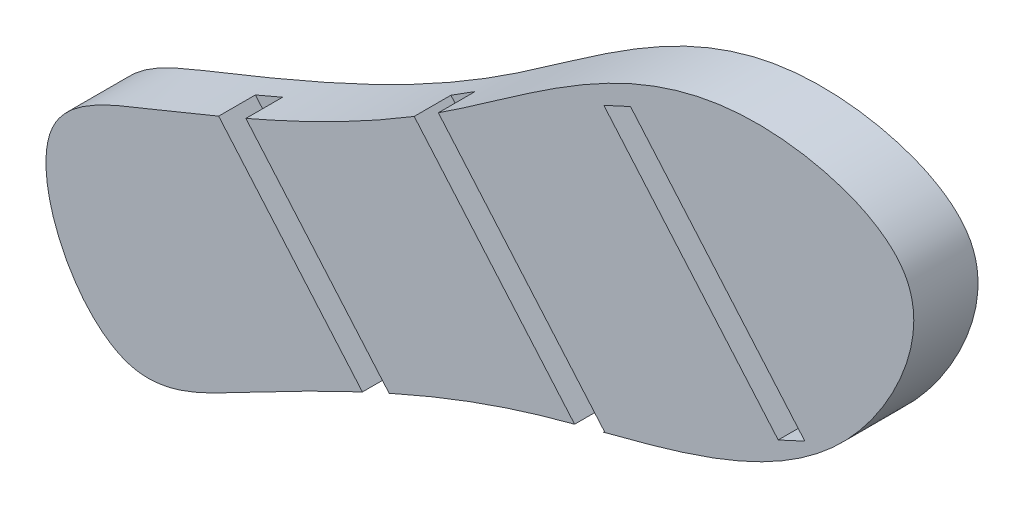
from build123d import *

# Parameters (mm, degrees)
GOMA_START         = 12.5
GOMA_DEPTH         = 3.5
RANURAS_AGUA_DEPTH = 2


with BuildPart() as part:
    # Sk_Goma → Goma (new body)
    with BuildSketch(Plane.XY.offset(GOMA_START)):
        with BuildLine():
            add(Edge.make_bspline(
                [(431.734976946, 343.776693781), (432.52405624, 345.528087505), (441.146604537, 348.888155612), (453.620501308, 354.288763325), (465.962705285, 365.603111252), (480.557784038, 360.803442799), (474.741212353, 346.583012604), (458.123888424, 344.531424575), (445.921336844, 338.54290228), (434.386282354, 332.342242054), (430.437738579, 340.897420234), (431.734976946, 343.776693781)],
                knots=[0, 0, 0, 0, 0.053449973, 0.211657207, 0.387434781, 0.456064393, 0.524694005, 0.700471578, 0.858678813, 0.912128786, 1, 1, 1, 1], degree=3))
        make_face()
    extrude(amount=GOMA_DEPTH)

    # Sk_Ranuras_agua → Ranuras_agua (cut)
    with BuildSketch(Plane.XY.offset(12.5)):
        Polygon((439.976454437, 349.783194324), (441.429189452, 350.453687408), (450.927841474, 339.418488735), (449.475106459, 338.747995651), align=None)
        Polygon((450.871967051, 354.811892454), (452.324702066, 355.482385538), (461.823354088, 344.447186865), (460.370619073, 343.776693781), align=None)
        Polygon((461.767479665, 359.840590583), (463.22021468, 360.511083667), (472.718866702, 349.475884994), (471.266131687, 348.80539191), align=None)
    extrude(amount=RANURAS_AGUA_DEPTH, mode=Mode.SUBTRACT)


with BuildPart() as body_2:
    # Simetria_lado_izq: mirrored copy
    add(part.part.mirror(Plane.XY))


solid = body_2.part
